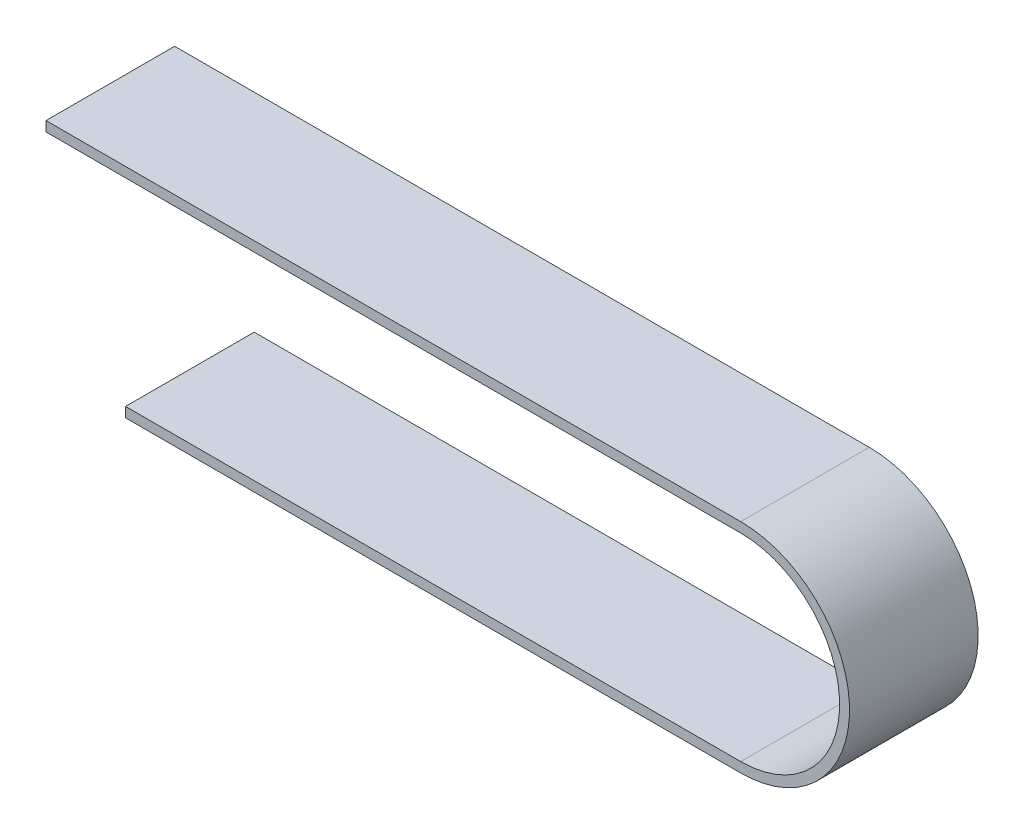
ISO-10303-21;
HEADER;
FILE_DESCRIPTION(('STEP AP214'),'2;1');
FILE_NAME('part.step','',(''),(''),'','','');
FILE_SCHEMA(('AUTOMOTIVE_DESIGN { 1 0 10303 214 1 1 1 1 }'));
ENDSEC;
DATA;
#1=APPLICATION_CONTEXT('core data for automotive mechanical design processes');
#2=APPLICATION_PROTOCOL_DEFINITION('international standard','automotive_design',2000,#1);
#3=PRODUCT_CONTEXT('',#1,'mechanical');
#4=PRODUCT('Part','Part','',(#3));
#5=PRODUCT_RELATED_PRODUCT_CATEGORY('part','',(#4));
#6=PRODUCT_DEFINITION_FORMATION('','',#4);
#7=PRODUCT_DEFINITION_CONTEXT('part definition',#1,'design');
#8=PRODUCT_DEFINITION('design','',#6,#7);
#9=PRODUCT_DEFINITION_SHAPE('','',#8);
#10=(LENGTH_UNIT() NAMED_UNIT(*) SI_UNIT(.MILLI.,.METRE.));
#11=(NAMED_UNIT(*) PLANE_ANGLE_UNIT() SI_UNIT($,.RADIAN.));
#12=(NAMED_UNIT(*) SI_UNIT($,.STERADIAN.) SOLID_ANGLE_UNIT());
#13=UNCERTAINTY_MEASURE_WITH_UNIT(LENGTH_MEASURE(1.E-05),#10,'distance_accuracy_value','');
#14=(GEOMETRIC_REPRESENTATION_CONTEXT(3) GLOBAL_UNCERTAINTY_ASSIGNED_CONTEXT((#13)) GLOBAL_UNIT_ASSIGNED_CONTEXT((#10,
#11,#12)) REPRESENTATION_CONTEXT('',''));
#15=CARTESIAN_POINT('',(0.,0.,0.));
#16=DIRECTION('',(0.,0.,1.));
#17=DIRECTION('',(1.,0.,0.));
#18=AXIS2_PLACEMENT_3D('',#15,#16,#17);
#19=CARTESIAN_POINT('',(0.,0.,130.));
#20=DIRECTION('',(0.,0.,-1.));
#21=DIRECTION('',(-1.,0.,0.));
#22=AXIS2_PLACEMENT_3D('',#19,#20,#21);
#23=CYLINDRICAL_SURFACE('',#22,110.);
#24=CARTESIAN_POINT('',(0.,0.,0.));
#25=DIRECTION('',(0.,0.,1.));
#26=DIRECTION('',(1.,0.,0.));
#27=AXIS2_PLACEMENT_3D('',#24,#25,#26);
#28=CIRCLE('',#27,110.);
#29=CARTESIAN_POINT('',(0.,-110.,0.));
#30=VERTEX_POINT('',#29);
#31=CARTESIAN_POINT('',(0.,110.,0.));
#32=VERTEX_POINT('',#31);
#33=EDGE_CURVE('E100',#30,#32,#28,.T.);
#34=ORIENTED_EDGE('',*,*,#33,.T.);
#35=DIRECTION('',(0.,0.,-1.));
#36=VECTOR('',#35,1.);
#37=CARTESIAN_POINT('',(0.,110.,130.));
#38=LINE('',#37,#36);
#39=CARTESIAN_POINT('',(0.,110.,130.));
#40=VERTEX_POINT('',#39);
#41=EDGE_CURVE('E11',#40,#32,#38,.T.);
#42=ORIENTED_EDGE('',*,*,#41,.F.);
#43=CARTESIAN_POINT('',(0.,0.,130.));
#44=DIRECTION('',(0.,0.,1.));
#45=DIRECTION('',(1.,0.,0.));
#46=AXIS2_PLACEMENT_3D('',#43,#44,#45);
#47=CIRCLE('',#46,110.);
#48=CARTESIAN_POINT('',(0.,-110.,130.));
#49=VERTEX_POINT('',#48);
#50=EDGE_CURVE('E127',#49,#40,#47,.T.);
#51=ORIENTED_EDGE('',*,*,#50,.F.);
#52=DIRECTION('',(0.,0.,-1.));
#53=VECTOR('',#52,1.);
#54=CARTESIAN_POINT('',(0.,-110.,130.));
#55=LINE('',#54,#53);
#56=EDGE_CURVE('E113',#49,#30,#55,.T.);
#57=ORIENTED_EDGE('',*,*,#56,.T.);
#58=EDGE_LOOP('',(#34,#42,#51,#57));
#59=FACE_BOUND('',#58,.T.);
#60=ADVANCED_FACE('F32',(#59),#23,.T.);
#61=CARTESIAN_POINT('',(0.,110.,130.));
#62=DIRECTION('',(0.,-1.,0.));
#63=DIRECTION('',(0.,0.,-1.));
#64=AXIS2_PLACEMENT_3D('',#61,#62,#63);
#65=PLANE('',#64);
#66=DIRECTION('',(-1.,0.,0.));
#67=VECTOR('',#66,1.);
#68=CARTESIAN_POINT('',(0.,110.,0.));
#69=LINE('',#68,#67);
#70=CARTESIAN_POINT('',(-702.00093991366,110.,0.));
#71=VERTEX_POINT('',#70);
#72=EDGE_CURVE('E96',#32,#71,#69,.T.);
#73=ORIENTED_EDGE('',*,*,#72,.T.);
#74=DIRECTION('',(0.,0.,-1.));
#75=VECTOR('',#74,1.);
#76=CARTESIAN_POINT('',(-702.00093991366,110.,130.));
#77=LINE('',#76,#75);
#78=CARTESIAN_POINT('',(-702.00093991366,110.,130.));
#79=VERTEX_POINT('',#78);
#80=EDGE_CURVE('E39',#79,#71,#77,.T.);
#81=ORIENTED_EDGE('',*,*,#80,.F.);
#82=DIRECTION('',(-1.,0.,0.));
#83=VECTOR('',#82,1.);
#84=CARTESIAN_POINT('',(0.,110.,130.));
#85=LINE('',#84,#83);
#86=EDGE_CURVE('E109',#40,#79,#85,.T.);
#87=ORIENTED_EDGE('',*,*,#86,.F.);
#88=ORIENTED_EDGE('',*,*,#41,.T.);
#89=EDGE_LOOP('',(#73,#81,#87,#88));
#90=FACE_BOUND('',#89,.T.);
#91=ADVANCED_FACE('F108',(#90),#65,.F.);
#92=CARTESIAN_POINT('',(-702.00093991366,110.,130.));
#93=DIRECTION('',(1.,0.,0.));
#94=DIRECTION('',(0.,0.,-1.));
#95=AXIS2_PLACEMENT_3D('',#92,#93,#94);
#96=PLANE('',#95);
#97=DIRECTION('',(0.,-1.,0.));
#98=VECTOR('',#97,1.);
#99=CARTESIAN_POINT('',(-702.00093991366,110.,0.));
#100=LINE('',#99,#98);
#101=CARTESIAN_POINT('',(-702.00093991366,100.,0.));
#102=VERTEX_POINT('',#101);
#103=EDGE_CURVE('E102',#71,#102,#100,.T.);
#104=ORIENTED_EDGE('',*,*,#103,.T.);
#105=DIRECTION('',(0.,0.,-1.));
#106=VECTOR('',#105,1.);
#107=CARTESIAN_POINT('',(-702.00093991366,100.,130.));
#108=LINE('',#107,#106);
#109=CARTESIAN_POINT('',(-702.00093991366,100.,130.));
#110=VERTEX_POINT('',#109);
#111=EDGE_CURVE('E153',#110,#102,#108,.T.);
#112=ORIENTED_EDGE('',*,*,#111,.F.);
#113=DIRECTION('',(0.,-1.,0.));
#114=VECTOR('',#113,1.);
#115=CARTESIAN_POINT('',(-702.00093991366,110.,130.));
#116=LINE('',#115,#114);
#117=EDGE_CURVE('E130',#79,#110,#116,.T.);
#118=ORIENTED_EDGE('',*,*,#117,.F.);
#119=ORIENTED_EDGE('',*,*,#80,.T.);
#120=EDGE_LOOP('',(#104,#112,#118,#119));
#121=FACE_BOUND('',#120,.T.);
#122=ADVANCED_FACE('F157',(#121),#96,.F.);
#123=CARTESIAN_POINT('',(0.,100.,130.));
#124=DIRECTION('',(0.,1.,0.));
#125=DIRECTION('',(0.,0.,1.));
#126=AXIS2_PLACEMENT_3D('',#123,#124,#125);
#127=PLANE('',#126);
#128=DIRECTION('',(1.,0.,0.));
#129=VECTOR('',#128,1.);
#130=CARTESIAN_POINT('',(0.,100.,0.));
#131=LINE('',#130,#129);
#132=CARTESIAN_POINT('',(0.,100.,0.));
#133=VERTEX_POINT('',#132);
#134=EDGE_CURVE('E117',#102,#133,#131,.T.);
#135=ORIENTED_EDGE('',*,*,#134,.T.);
#136=DIRECTION('',(0.,0.,-1.));
#137=VECTOR('',#136,1.);
#138=CARTESIAN_POINT('',(0.,100.,130.));
#139=LINE('',#138,#137);
#140=CARTESIAN_POINT('',(0.,100.,130.));
#141=VERTEX_POINT('',#140);
#142=EDGE_CURVE('E150',#141,#133,#139,.T.);
#143=ORIENTED_EDGE('',*,*,#142,.F.);
#144=DIRECTION('',(1.,0.,0.));
#145=VECTOR('',#144,1.);
#146=CARTESIAN_POINT('',(0.,100.,130.));
#147=LINE('',#146,#145);
#148=EDGE_CURVE('E132',#110,#141,#147,.T.);
#149=ORIENTED_EDGE('',*,*,#148,.F.);
#150=ORIENTED_EDGE('',*,*,#111,.T.);
#151=EDGE_LOOP('',(#135,#143,#149,#150));
#152=FACE_BOUND('',#151,.T.);
#153=ADVANCED_FACE('F165',(#152),#127,.F.);
#154=CARTESIAN_POINT('',(0.,0.,130.));
#155=DIRECTION('',(0.,0.,-1.));
#156=DIRECTION('',(-1.,0.,0.));
#157=AXIS2_PLACEMENT_3D('',#154,#155,#156);
#158=CYLINDRICAL_SURFACE('',#157,100.);
#159=CARTESIAN_POINT('',(0.,0.,0.));
#160=DIRECTION('',(0.,0.,-1.));
#161=DIRECTION('',(1.,0.,0.));
#162=AXIS2_PLACEMENT_3D('',#159,#160,#161);
#163=CIRCLE('',#162,100.);
#164=CARTESIAN_POINT('',(0.,-100.,0.));
#165=VERTEX_POINT('',#164);
#166=EDGE_CURVE('E119',#133,#165,#163,.T.);
#167=ORIENTED_EDGE('',*,*,#166,.T.);
#168=DIRECTION('',(0.,0.,-1.));
#169=VECTOR('',#168,1.);
#170=CARTESIAN_POINT('',(0.,-100.,130.));
#171=LINE('',#170,#169);
#172=CARTESIAN_POINT('',(0.,-100.,130.));
#173=VERTEX_POINT('',#172);
#174=EDGE_CURVE('E147',#173,#165,#171,.T.);
#175=ORIENTED_EDGE('',*,*,#174,.F.);
#176=CARTESIAN_POINT('',(0.,0.,130.));
#177=DIRECTION('',(0.,0.,-1.));
#178=DIRECTION('',(1.,0.,0.));
#179=AXIS2_PLACEMENT_3D('',#176,#177,#178);
#180=CIRCLE('',#179,100.);
#181=EDGE_CURVE('E134',#141,#173,#180,.T.);
#182=ORIENTED_EDGE('',*,*,#181,.F.);
#183=ORIENTED_EDGE('',*,*,#142,.T.);
#184=EDGE_LOOP('',(#167,#175,#182,#183));
#185=FACE_BOUND('',#184,.T.);
#186=ADVANCED_FACE('F168',(#185),#158,.F.);
#187=CARTESIAN_POINT('',(0.,-100.,130.));
#188=DIRECTION('',(0.,-1.,0.));
#189=DIRECTION('',(0.,0.,-1.));
#190=AXIS2_PLACEMENT_3D('',#187,#188,#189);
#191=PLANE('',#190);
#192=DIRECTION('',(-1.,0.,0.));
#193=VECTOR('',#192,1.);
#194=CARTESIAN_POINT('',(0.,-100.,0.));
#195=LINE('',#194,#193);
#196=CARTESIAN_POINT('',(-621.603057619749,-100.,0.));
#197=VERTEX_POINT('',#196);
#198=EDGE_CURVE('E121',#165,#197,#195,.T.);
#199=ORIENTED_EDGE('',*,*,#198,.T.);
#200=DIRECTION('',(0.,0.,-1.));
#201=VECTOR('',#200,1.);
#202=CARTESIAN_POINT('',(-621.603057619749,-100.,130.));
#203=LINE('',#202,#201);
#204=CARTESIAN_POINT('',(-621.603057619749,-100.,130.));
#205=VERTEX_POINT('',#204);
#206=EDGE_CURVE('E144',#205,#197,#203,.T.);
#207=ORIENTED_EDGE('',*,*,#206,.F.);
#208=DIRECTION('',(-1.,0.,0.));
#209=VECTOR('',#208,1.);
#210=CARTESIAN_POINT('',(0.,-100.,130.));
#211=LINE('',#210,#209);
#212=EDGE_CURVE('E136',#173,#205,#211,.T.);
#213=ORIENTED_EDGE('',*,*,#212,.F.);
#214=ORIENTED_EDGE('',*,*,#174,.T.);
#215=EDGE_LOOP('',(#199,#207,#213,#214));
#216=FACE_BOUND('',#215,.T.);
#217=ADVANCED_FACE('F173',(#216),#191,.F.);
#218=CARTESIAN_POINT('',(-621.603057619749,-110.,130.));
#219=DIRECTION('',(1.,0.,0.));
#220=DIRECTION('',(0.,0.,-1.));
#221=AXIS2_PLACEMENT_3D('',#218,#219,#220);
#222=PLANE('',#221);
#223=DIRECTION('',(0.,-1.,0.));
#224=VECTOR('',#223,1.);
#225=CARTESIAN_POINT('',(-621.603057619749,-110.,0.));
#226=LINE('',#225,#224);
#227=CARTESIAN_POINT('',(-621.603057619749,-110.,0.));
#228=VERTEX_POINT('',#227);
#229=EDGE_CURVE('E123',#197,#228,#226,.T.);
#230=ORIENTED_EDGE('',*,*,#229,.T.);
#231=DIRECTION('',(0.,0.,-1.));
#232=VECTOR('',#231,1.);
#233=CARTESIAN_POINT('',(-621.603057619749,-110.,130.));
#234=LINE('',#233,#232);
#235=CARTESIAN_POINT('',(-621.603057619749,-110.,130.));
#236=VERTEX_POINT('',#235);
#237=EDGE_CURVE('E141',#236,#228,#234,.T.);
#238=ORIENTED_EDGE('',*,*,#237,.F.);
#239=DIRECTION('',(0.,-1.,0.));
#240=VECTOR('',#239,1.);
#241=CARTESIAN_POINT('',(-621.603057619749,-110.,130.));
#242=LINE('',#241,#240);
#243=EDGE_CURVE('E51',#205,#236,#242,.T.);
#244=ORIENTED_EDGE('',*,*,#243,.F.);
#245=ORIENTED_EDGE('',*,*,#206,.T.);
#246=EDGE_LOOP('',(#230,#238,#244,#245));
#247=FACE_BOUND('',#246,.T.);
#248=ADVANCED_FACE('F176',(#247),#222,.F.);
#249=CARTESIAN_POINT('',(0.,-110.,130.));
#250=DIRECTION('',(0.,1.,0.));
#251=DIRECTION('',(0.,0.,1.));
#252=AXIS2_PLACEMENT_3D('',#249,#250,#251);
#253=PLANE('',#252);
#254=DIRECTION('',(1.,0.,0.));
#255=VECTOR('',#254,1.);
#256=CARTESIAN_POINT('',(0.,-110.,0.));
#257=LINE('',#256,#255);
#258=EDGE_CURVE('E125',#228,#30,#257,.T.);
#259=ORIENTED_EDGE('',*,*,#258,.T.);
#260=ORIENTED_EDGE('',*,*,#56,.F.);
#261=DIRECTION('',(1.,0.,0.));
#262=VECTOR('',#261,1.);
#263=CARTESIAN_POINT('',(0.,-110.,130.));
#264=LINE('',#263,#262);
#265=EDGE_CURVE('E46',#236,#49,#264,.T.);
#266=ORIENTED_EDGE('',*,*,#265,.F.);
#267=ORIENTED_EDGE('',*,*,#237,.T.);
#268=EDGE_LOOP('',(#259,#260,#266,#267));
#269=FACE_BOUND('',#268,.T.);
#270=ADVANCED_FACE('F178',(#269),#253,.F.);
#271=CARTESIAN_POINT('',(0.,0.,130.));
#272=DIRECTION('',(0.,0.,1.));
#273=DIRECTION('',(1.,0.,0.));
#274=AXIS2_PLACEMENT_3D('',#271,#272,#273);
#275=PLANE('',#274);
#276=ORIENTED_EDGE('',*,*,#50,.T.);
#277=ORIENTED_EDGE('',*,*,#86,.T.);
#278=ORIENTED_EDGE('',*,*,#117,.T.);
#279=ORIENTED_EDGE('',*,*,#148,.T.);
#280=ORIENTED_EDGE('',*,*,#181,.T.);
#281=ORIENTED_EDGE('',*,*,#212,.T.);
#282=ORIENTED_EDGE('',*,*,#243,.T.);
#283=ORIENTED_EDGE('',*,*,#265,.T.);
#284=EDGE_LOOP('',(#276,#277,#278,#279,#280,#281,#282,#283));
#285=FACE_BOUND('',#284,.T.);
#286=ADVANCED_FACE('F160',(#285),#275,.T.);
#287=CARTESIAN_POINT('',(0.,0.,0.));
#288=DIRECTION('',(0.,0.,1.));
#289=DIRECTION('',(1.,0.,0.));
#290=AXIS2_PLACEMENT_3D('',#287,#288,#289);
#291=PLANE('',#290);
#292=ORIENTED_EDGE('',*,*,#33,.F.);
#293=ORIENTED_EDGE('',*,*,#258,.F.);
#294=ORIENTED_EDGE('',*,*,#229,.F.);
#295=ORIENTED_EDGE('',*,*,#198,.F.);
#296=ORIENTED_EDGE('',*,*,#166,.F.);
#297=ORIENTED_EDGE('',*,*,#134,.F.);
#298=ORIENTED_EDGE('',*,*,#103,.F.);
#299=ORIENTED_EDGE('',*,*,#72,.F.);
#300=EDGE_LOOP('',(#292,#293,#294,#295,#296,#297,#298,#299));
#301=FACE_BOUND('',#300,.T.);
#302=ADVANCED_FACE('F97',(#301),#291,.F.);
#303=CLOSED_SHELL('',(#60,#91,#122,#153,#186,#217,#248,#270,#286,#302));
#304=MANIFOLD_SOLID_BREP('B2',#303);
#305=ADVANCED_BREP_SHAPE_REPRESENTATION('',(#18,#304),#14);
#306=SHAPE_DEFINITION_REPRESENTATION(#9,#305);
ENDSEC;
END-ISO-10303-21;
